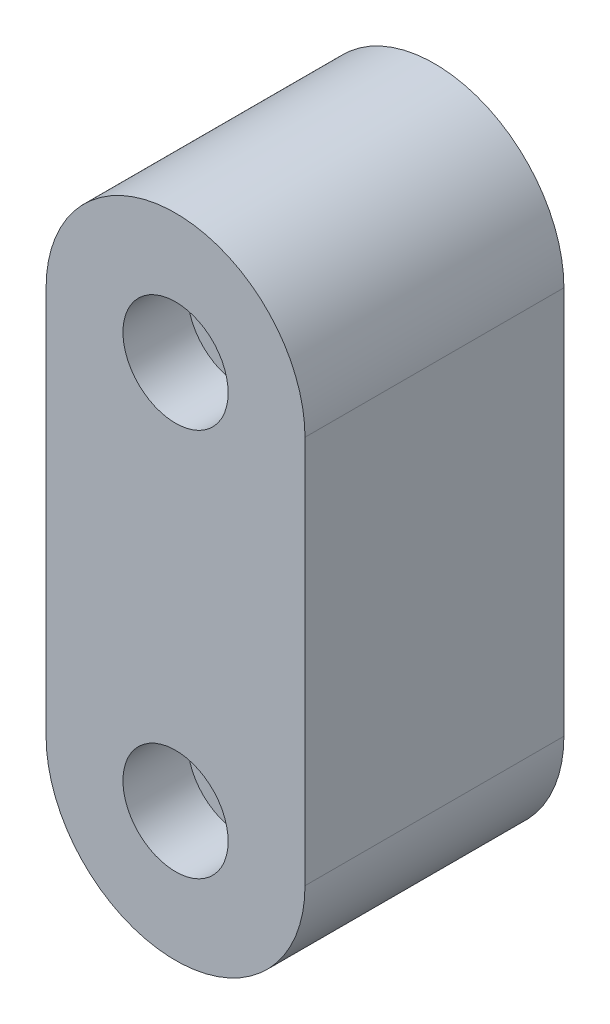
ISO-10303-21;
HEADER;
FILE_DESCRIPTION(('STEP AP214'),'2;1');
FILE_NAME('part.step','',(''),(''),'','','');
FILE_SCHEMA(('AUTOMOTIVE_DESIGN { 1 0 10303 214 1 1 1 1 }'));
ENDSEC;
DATA;
#1=APPLICATION_CONTEXT('core data for automotive mechanical design processes');
#2=APPLICATION_PROTOCOL_DEFINITION('international standard','automotive_design',2000,#1);
#3=PRODUCT_CONTEXT('',#1,'mechanical');
#4=PRODUCT('Part','Part','',(#3));
#5=PRODUCT_RELATED_PRODUCT_CATEGORY('part','',(#4));
#6=PRODUCT_DEFINITION_FORMATION('','',#4);
#7=PRODUCT_DEFINITION_CONTEXT('part definition',#1,'design');
#8=PRODUCT_DEFINITION('design','',#6,#7);
#9=PRODUCT_DEFINITION_SHAPE('','',#8);
#10=(LENGTH_UNIT() NAMED_UNIT(*) SI_UNIT(.MILLI.,.METRE.));
#11=(NAMED_UNIT(*) PLANE_ANGLE_UNIT() SI_UNIT($,.RADIAN.));
#12=(NAMED_UNIT(*) SI_UNIT($,.STERADIAN.) SOLID_ANGLE_UNIT());
#13=UNCERTAINTY_MEASURE_WITH_UNIT(LENGTH_MEASURE(1.E-05),#10,'distance_accuracy_value','');
#14=(GEOMETRIC_REPRESENTATION_CONTEXT(3) GLOBAL_UNCERTAINTY_ASSIGNED_CONTEXT((#13)) GLOBAL_UNIT_ASSIGNED_CONTEXT((#10,
#11,#12)) REPRESENTATION_CONTEXT('',''));
#15=CARTESIAN_POINT('',(0.,0.,0.));
#16=DIRECTION('',(0.,0.,1.));
#17=DIRECTION('',(1.,0.,0.));
#18=AXIS2_PLACEMENT_3D('',#15,#16,#17);
#19=CARTESIAN_POINT('',(0.,16.,16.));
#20=DIRECTION('',(0.,0.,-1.));
#21=DIRECTION('',(-1.,0.,0.));
#22=AXIS2_PLACEMENT_3D('',#19,#20,#21);
#23=CYLINDRICAL_SURFACE('',#22,8.);
#24=CARTESIAN_POINT('',(0.,16.,0.));
#25=DIRECTION('',(0.,0.,1.));
#26=DIRECTION('',(1.,0.,0.));
#27=AXIS2_PLACEMENT_3D('',#24,#25,#26);
#28=CIRCLE('',#27,8.);
#29=CARTESIAN_POINT('',(8.,16.,0.));
#30=VERTEX_POINT('',#29);
#31=CARTESIAN_POINT('',(-8.,16.,0.));
#32=VERTEX_POINT('',#31);
#33=EDGE_CURVE('E97',#30,#32,#28,.T.);
#34=ORIENTED_EDGE('',*,*,#33,.T.);
#35=DIRECTION('',(0.,0.,-1.));
#36=VECTOR('',#35,1.);
#37=CARTESIAN_POINT('',(-8.,16.,16.));
#38=LINE('',#37,#36);
#39=CARTESIAN_POINT('',(-8.,16.,16.));
#40=VERTEX_POINT('',#39);
#41=EDGE_CURVE('E11',#40,#32,#38,.T.);
#42=ORIENTED_EDGE('',*,*,#41,.F.);
#43=CARTESIAN_POINT('',(0.,16.,16.));
#44=DIRECTION('',(0.,0.,1.));
#45=DIRECTION('',(1.,0.,0.));
#46=AXIS2_PLACEMENT_3D('',#43,#44,#45);
#47=CIRCLE('',#46,8.);
#48=CARTESIAN_POINT('',(8.,16.,16.));
#49=VERTEX_POINT('',#48);
#50=EDGE_CURVE('E85',#49,#40,#47,.T.);
#51=ORIENTED_EDGE('',*,*,#50,.F.);
#52=DIRECTION('',(0.,0.,-1.));
#53=VECTOR('',#52,1.);
#54=CARTESIAN_POINT('',(8.,16.,16.));
#55=LINE('',#54,#53);
#56=EDGE_CURVE('E93',#49,#30,#55,.T.);
#57=ORIENTED_EDGE('',*,*,#56,.T.);
#58=EDGE_LOOP('',(#34,#42,#51,#57));
#59=FACE_BOUND('',#58,.T.);
#60=ADVANCED_FACE('F34',(#59),#23,.T.);
#61=CARTESIAN_POINT('',(-8.,16.,16.));
#62=DIRECTION('',(1.,0.,0.));
#63=DIRECTION('',(0.,1.,0.));
#64=AXIS2_PLACEMENT_3D('',#61,#62,#63);
#65=PLANE('',#64);
#66=DIRECTION('',(0.,-1.,0.));
#67=VECTOR('',#66,1.);
#68=CARTESIAN_POINT('',(-8.,16.,0.));
#69=LINE('',#68,#67);
#70=CARTESIAN_POINT('',(-7.99999999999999,-8.,0.));
#71=VERTEX_POINT('',#70);
#72=EDGE_CURVE('E89',#32,#71,#69,.T.);
#73=ORIENTED_EDGE('',*,*,#72,.T.);
#74=DIRECTION('',(0.,0.,-1.));
#75=VECTOR('',#74,1.);
#76=CARTESIAN_POINT('',(-7.99999999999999,-8.,16.));
#77=LINE('',#76,#75);
#78=CARTESIAN_POINT('',(-7.99999999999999,-8.,16.));
#79=VERTEX_POINT('',#78);
#80=EDGE_CURVE('E42',#79,#71,#77,.T.);
#81=ORIENTED_EDGE('',*,*,#80,.F.);
#82=DIRECTION('',(0.,-1.,0.));
#83=VECTOR('',#82,1.);
#84=CARTESIAN_POINT('',(-8.,16.,16.));
#85=LINE('',#84,#83);
#86=EDGE_CURVE('E80',#40,#79,#85,.T.);
#87=ORIENTED_EDGE('',*,*,#86,.F.);
#88=ORIENTED_EDGE('',*,*,#41,.T.);
#89=EDGE_LOOP('',(#73,#81,#87,#88));
#90=FACE_BOUND('',#89,.T.);
#91=ADVANCED_FACE('F88',(#90),#65,.F.);
#92=CARTESIAN_POINT('',(0.,-8.,16.));
#93=DIRECTION('',(0.,0.,-1.));
#94=DIRECTION('',(-1.,0.,0.));
#95=AXIS2_PLACEMENT_3D('',#92,#93,#94);
#96=CYLINDRICAL_SURFACE('',#95,8.);
#97=CARTESIAN_POINT('',(0.,-8.,0.));
#98=DIRECTION('',(0.,0.,1.));
#99=DIRECTION('',(1.,0.,0.));
#100=AXIS2_PLACEMENT_3D('',#97,#98,#99);
#101=CIRCLE('',#100,8.);
#102=CARTESIAN_POINT('',(8.,-8.,0.));
#103=VERTEX_POINT('',#102);
#104=EDGE_CURVE('E67',#71,#103,#101,.T.);
#105=ORIENTED_EDGE('',*,*,#104,.T.);
#106=DIRECTION('',(0.,0.,-1.));
#107=VECTOR('',#106,1.);
#108=CARTESIAN_POINT('',(8.,-8.,16.));
#109=LINE('',#108,#107);
#110=CARTESIAN_POINT('',(8.,-8.,16.));
#111=VERTEX_POINT('',#110);
#112=EDGE_CURVE('E90',#111,#103,#109,.T.);
#113=ORIENTED_EDGE('',*,*,#112,.F.);
#114=CARTESIAN_POINT('',(0.,-8.,16.));
#115=DIRECTION('',(0.,0.,1.));
#116=DIRECTION('',(1.,0.,0.));
#117=AXIS2_PLACEMENT_3D('',#114,#115,#116);
#118=CIRCLE('',#117,8.);
#119=EDGE_CURVE('E83',#79,#111,#118,.T.);
#120=ORIENTED_EDGE('',*,*,#119,.F.);
#121=ORIENTED_EDGE('',*,*,#80,.T.);
#122=EDGE_LOOP('',(#105,#113,#120,#121));
#123=FACE_BOUND('',#122,.T.);
#124=ADVANCED_FACE('F91',(#123),#96,.T.);
#125=CARTESIAN_POINT('',(8.,16.,16.));
#126=DIRECTION('',(-1.,0.,0.));
#127=DIRECTION('',(0.,-1.,0.));
#128=AXIS2_PLACEMENT_3D('',#125,#126,#127);
#129=PLANE('',#128);
#130=DIRECTION('',(0.,1.,0.));
#131=VECTOR('',#130,1.);
#132=CARTESIAN_POINT('',(8.,16.,0.));
#133=LINE('',#132,#131);
#134=EDGE_CURVE('E73',#103,#30,#133,.T.);
#135=ORIENTED_EDGE('',*,*,#134,.T.);
#136=ORIENTED_EDGE('',*,*,#56,.F.);
#137=DIRECTION('',(0.,1.,0.));
#138=VECTOR('',#137,1.);
#139=CARTESIAN_POINT('',(8.,16.,16.));
#140=LINE('',#139,#138);
#141=EDGE_CURVE('E50',#111,#49,#140,.T.);
#142=ORIENTED_EDGE('',*,*,#141,.F.);
#143=ORIENTED_EDGE('',*,*,#112,.T.);
#144=EDGE_LOOP('',(#135,#136,#142,#143));
#145=FACE_BOUND('',#144,.T.);
#146=ADVANCED_FACE('F105',(#145),#129,.F.);
#147=CARTESIAN_POINT('',(0.,16.,16.));
#148=DIRECTION('',(0.,0.,1.));
#149=DIRECTION('',(1.,0.,0.));
#150=AXIS2_PLACEMENT_3D('',#147,#148,#149);
#151=PLANE('',#150);
#152=CARTESIAN_POINT('',(0.,16.,16.));
#153=DIRECTION('',(0.,0.,1.));
#154=DIRECTION('',(1.,0.,0.));
#155=AXIS2_PLACEMENT_3D('',#152,#153,#154);
#156=CIRCLE('',#155,3.25);
#157=CARTESIAN_POINT('',(3.25,16.,16.));
#158=VERTEX_POINT('',#157);
#159=EDGE_CURVE('E131',#158,#158,#156,.T.);
#160=ORIENTED_EDGE('',*,*,#159,.F.);
#161=EDGE_LOOP('',(#160));
#162=FACE_BOUND('',#161,.T.);
#163=CARTESIAN_POINT('',(0.,-8.,16.));
#164=DIRECTION('',(0.,0.,1.));
#165=DIRECTION('',(1.,0.,0.));
#166=AXIS2_PLACEMENT_3D('',#163,#164,#165);
#167=CIRCLE('',#166,3.25);
#168=CARTESIAN_POINT('',(3.25,-8.,16.));
#169=VERTEX_POINT('',#168);
#170=EDGE_CURVE('E119',#169,#169,#167,.T.);
#171=ORIENTED_EDGE('',*,*,#170,.F.);
#172=EDGE_LOOP('',(#171));
#173=FACE_BOUND('',#172,.T.);
#174=ORIENTED_EDGE('',*,*,#50,.T.);
#175=ORIENTED_EDGE('',*,*,#86,.T.);
#176=ORIENTED_EDGE('',*,*,#119,.T.);
#177=ORIENTED_EDGE('',*,*,#141,.T.);
#178=EDGE_LOOP('',(#174,#175,#176,#177));
#179=FACE_BOUND('',#178,.T.);
#180=ADVANCED_FACE('F81',(#162,#173,#179),#151,.T.);
#181=CARTESIAN_POINT('',(0.,16.,0.));
#182=DIRECTION('',(0.,0.,1.));
#183=DIRECTION('',(1.,0.,0.));
#184=AXIS2_PLACEMENT_3D('',#181,#182,#183);
#185=PLANE('',#184);
#186=CARTESIAN_POINT('',(0.,16.,0.));
#187=DIRECTION('',(0.,0.,1.));
#188=DIRECTION('',(1.,0.,0.));
#189=AXIS2_PLACEMENT_3D('',#186,#187,#188);
#190=CIRCLE('',#189,1.70000000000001);
#191=CARTESIAN_POINT('',(1.70000000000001,16.,0.));
#192=VERTEX_POINT('',#191);
#193=EDGE_CURVE('E122',#192,#192,#190,.T.);
#194=ORIENTED_EDGE('',*,*,#193,.T.);
#195=EDGE_LOOP('',(#194));
#196=FACE_BOUND('',#195,.T.);
#197=CARTESIAN_POINT('',(0.,-8.,0.));
#198=DIRECTION('',(0.,0.,1.));
#199=DIRECTION('',(1.,0.,0.));
#200=AXIS2_PLACEMENT_3D('',#197,#198,#199);
#201=CIRCLE('',#200,1.70000000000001);
#202=CARTESIAN_POINT('',(1.70000000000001,-8.,0.));
#203=VERTEX_POINT('',#202);
#204=EDGE_CURVE('E100',#203,#203,#201,.T.);
#205=ORIENTED_EDGE('',*,*,#204,.T.);
#206=EDGE_LOOP('',(#205));
#207=FACE_BOUND('',#206,.T.);
#208=ORIENTED_EDGE('',*,*,#33,.F.);
#209=ORIENTED_EDGE('',*,*,#134,.F.);
#210=ORIENTED_EDGE('',*,*,#104,.F.);
#211=ORIENTED_EDGE('',*,*,#72,.F.);
#212=EDGE_LOOP('',(#208,#209,#210,#211));
#213=FACE_BOUND('',#212,.T.);
#214=ADVANCED_FACE('F108',(#196,#207,#213),#185,.F.);
#215=CARTESIAN_POINT('',(0.,-8.,16.));
#216=DIRECTION('',(0.,0.,1.));
#217=DIRECTION('',(1.,0.,0.));
#218=AXIS2_PLACEMENT_3D('',#215,#216,#217);
#219=CYLINDRICAL_SURFACE('',#218,1.70000000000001);
#220=ORIENTED_EDGE('',*,*,#204,.F.);
#221=EDGE_LOOP('',(#220));
#222=FACE_BOUND('',#221,.T.);
#223=CARTESIAN_POINT('',(0.,-8.,12.));
#224=DIRECTION('',(0.,0.,1.));
#225=DIRECTION('',(1.,0.,0.));
#226=AXIS2_PLACEMENT_3D('',#223,#224,#225);
#227=CIRCLE('',#226,1.70000000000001);
#228=CARTESIAN_POINT('',(1.70000000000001,-8.,12.));
#229=VERTEX_POINT('',#228);
#230=EDGE_CURVE('E113',#229,#229,#227,.T.);
#231=ORIENTED_EDGE('',*,*,#230,.T.);
#232=EDGE_LOOP('',(#231));
#233=FACE_BOUND('',#232,.T.);
#234=ADVANCED_FACE('F155',(#222,#233),#219,.F.);
#235=CARTESIAN_POINT('',(1.70000000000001,-8.,12.));
#236=DIRECTION('',(0.,0.,-1.));
#237=DIRECTION('',(-1.,0.,0.));
#238=AXIS2_PLACEMENT_3D('',#235,#236,#237);
#239=PLANE('',#238);
#240=ORIENTED_EDGE('',*,*,#230,.F.);
#241=EDGE_LOOP('',(#240));
#242=FACE_BOUND('',#241,.T.);
#243=CARTESIAN_POINT('',(0.,-8.,12.));
#244=DIRECTION('',(0.,0.,1.));
#245=DIRECTION('',(1.,0.,0.));
#246=AXIS2_PLACEMENT_3D('',#243,#244,#245);
#247=CIRCLE('',#246,3.25);
#248=CARTESIAN_POINT('',(3.25,-8.,12.));
#249=VERTEX_POINT('',#248);
#250=EDGE_CURVE('E116',#249,#249,#247,.T.);
#251=ORIENTED_EDGE('',*,*,#250,.T.);
#252=EDGE_LOOP('',(#251));
#253=FACE_BOUND('',#252,.T.);
#254=ADVANCED_FACE('F145',(#242,#253),#239,.F.);
#255=CARTESIAN_POINT('',(0.,-8.,16.));
#256=DIRECTION('',(0.,0.,1.));
#257=DIRECTION('',(1.,0.,0.));
#258=AXIS2_PLACEMENT_3D('',#255,#256,#257);
#259=CYLINDRICAL_SURFACE('',#258,3.25);
#260=ORIENTED_EDGE('',*,*,#250,.F.);
#261=EDGE_LOOP('',(#260));
#262=FACE_BOUND('',#261,.T.);
#263=ORIENTED_EDGE('',*,*,#170,.T.);
#264=EDGE_LOOP('',(#263));
#265=FACE_BOUND('',#264,.T.);
#266=ADVANCED_FACE('F142',(#262,#265),#259,.F.);
#267=CARTESIAN_POINT('',(0.,16.,16.));
#268=DIRECTION('',(0.,0.,1.));
#269=DIRECTION('',(1.,0.,0.));
#270=AXIS2_PLACEMENT_3D('',#267,#268,#269);
#271=CYLINDRICAL_SURFACE('',#270,1.70000000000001);
#272=ORIENTED_EDGE('',*,*,#193,.F.);
#273=EDGE_LOOP('',(#272));
#274=FACE_BOUND('',#273,.T.);
#275=CARTESIAN_POINT('',(0.,16.,12.));
#276=DIRECTION('',(0.,0.,1.));
#277=DIRECTION('',(1.,0.,0.));
#278=AXIS2_PLACEMENT_3D('',#275,#276,#277);
#279=CIRCLE('',#278,1.70000000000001);
#280=CARTESIAN_POINT('',(1.70000000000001,16.,12.));
#281=VERTEX_POINT('',#280);
#282=EDGE_CURVE('E125',#281,#281,#279,.T.);
#283=ORIENTED_EDGE('',*,*,#282,.T.);
#284=EDGE_LOOP('',(#283));
#285=FACE_BOUND('',#284,.T.);
#286=ADVANCED_FACE('F144',(#274,#285),#271,.F.);
#287=CARTESIAN_POINT('',(1.70000000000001,16.,12.));
#288=DIRECTION('',(0.,0.,-1.));
#289=DIRECTION('',(-1.,0.,0.));
#290=AXIS2_PLACEMENT_3D('',#287,#288,#289);
#291=PLANE('',#290);
#292=ORIENTED_EDGE('',*,*,#282,.F.);
#293=EDGE_LOOP('',(#292));
#294=FACE_BOUND('',#293,.T.);
#295=CARTESIAN_POINT('',(0.,16.,12.));
#296=DIRECTION('',(0.,0.,1.));
#297=DIRECTION('',(1.,0.,0.));
#298=AXIS2_PLACEMENT_3D('',#295,#296,#297);
#299=CIRCLE('',#298,3.25);
#300=CARTESIAN_POINT('',(3.25,16.,12.));
#301=VERTEX_POINT('',#300);
#302=EDGE_CURVE('E128',#301,#301,#299,.T.);
#303=ORIENTED_EDGE('',*,*,#302,.T.);
#304=EDGE_LOOP('',(#303));
#305=FACE_BOUND('',#304,.T.);
#306=ADVANCED_FACE('F152',(#294,#305),#291,.F.);
#307=CARTESIAN_POINT('',(0.,16.,16.));
#308=DIRECTION('',(0.,0.,1.));
#309=DIRECTION('',(1.,0.,0.));
#310=AXIS2_PLACEMENT_3D('',#307,#308,#309);
#311=CYLINDRICAL_SURFACE('',#310,3.25);
#312=ORIENTED_EDGE('',*,*,#302,.F.);
#313=EDGE_LOOP('',(#312));
#314=FACE_BOUND('',#313,.T.);
#315=ORIENTED_EDGE('',*,*,#159,.T.);
#316=EDGE_LOOP('',(#315));
#317=FACE_BOUND('',#316,.T.);
#318=ADVANCED_FACE('F135',(#314,#317),#311,.F.);
#319=CLOSED_SHELL('',(#60,#91,#124,#146,#180,#214,#234,#254,#266,#286,#306,#318));
#320=MANIFOLD_SOLID_BREP('B2',#319);
#321=ADVANCED_BREP_SHAPE_REPRESENTATION('',(#18,#320),#14);
#322=SHAPE_DEFINITION_REPRESENTATION(#9,#321);
ENDSEC;
END-ISO-10303-21;
